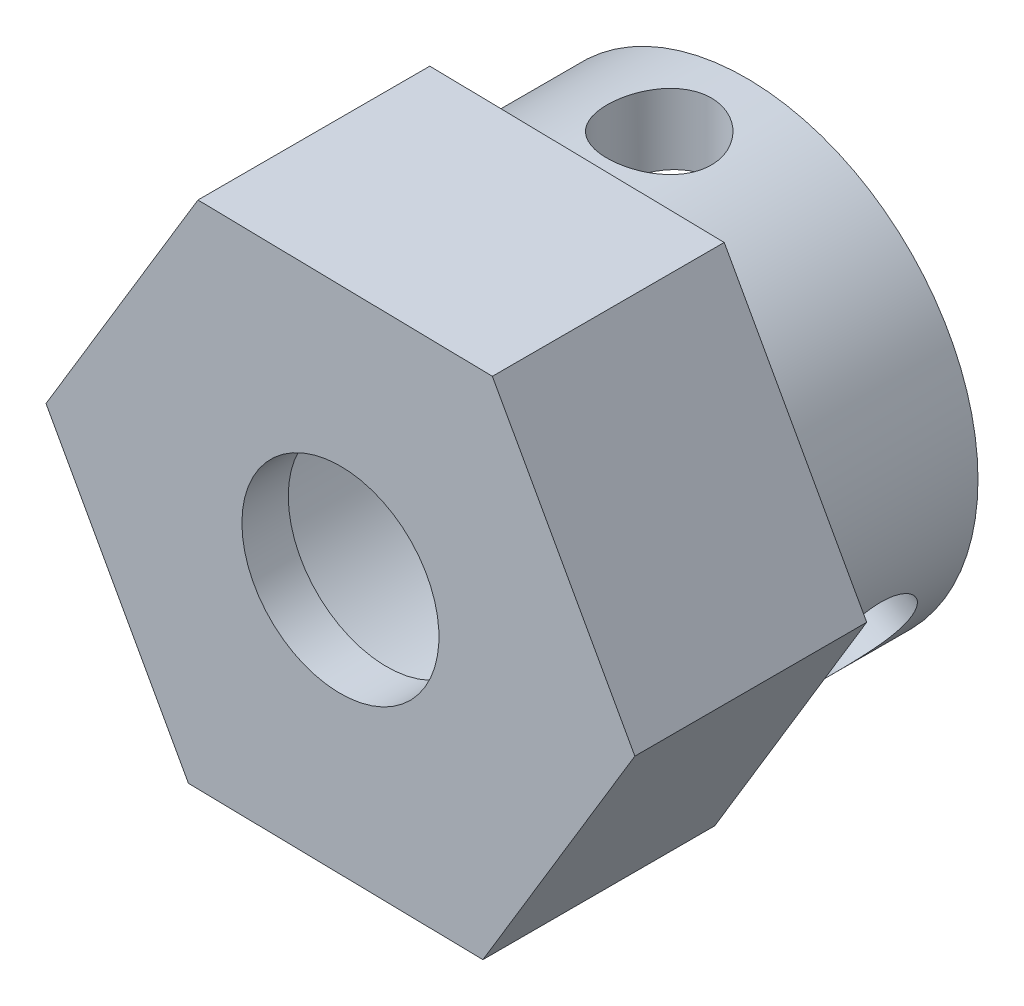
from build123d import *

# Parameters (mm, degrees)
SKETCH2_R           = 5.08
BOSS_EXTRUDE2_DEPTH = 8.89
BOSS_EXTRUDE3_DEPTH = 5.08
SKETCH3_R           = 3.556
CUT_EXTRUDE3_DEPTH  = 7.874
SKETCH6_R           = 2.159
CUT_EXTRUDE4_DEPTH  = 10.965704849
SKETCH7_R           = 1.143
CUT_EXTRUDE5_DEPTH  = 13.350747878
CIRPATTERN1_COUNT   = 3


with BuildPart() as part:
    # Sketch2 → Boss-Extrude2 (new body)
    with BuildSketch(Plane.XY):
        Circle(SKETCH2_R)
    extrude(amount=-BOSS_EXTRUDE2_DEPTH)

    # Sketch5 → Boss-Extrude3 (add)
    with BuildSketch(Plane.XY):
        Polygon((6.451350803, -0.119992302), (3.329591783, 5.527037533), (-3.12175902, 5.647029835), (-6.451350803, 0.119992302), (-3.329591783, -5.527037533), (3.12175902, -5.647029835), align=None)
    extrude(amount=-BOSS_EXTRUDE3_DEPTH)

    # Sketch3 → Cut-Extrude3 (cut)
    with BuildSketch(Plane(origin=(0, 0, -8.89), x_dir=(-1, 0, 0), z_dir=(0, 0, -1))):
        Circle(SKETCH3_R)
    extrude(amount=-CUT_EXTRUDE3_DEPTH, mode=Mode.SUBTRACT)

    # Sketch6 → Cut-Extrude4 (cut, through all)
    with BuildSketch(Plane(origin=(0, 0, -5.08), x_dir=(-1, 0, 0), z_dir=(0, 0, -1))):
        Circle(SKETCH6_R)
    extrude(amount=-CUT_EXTRUDE4_DEPTH, mode=Mode.SUBTRACT)

    # Sketch7 → Cut-Extrude5 (cut, through all)
    with BuildSketch(Plane(origin=(0, 0, 0), x_dir=(1, 0, 0), z_dir=(0, 1, 0))):
        with Locations(Location((0, 6.985, 0), (0, 0, 90))):
            Circle(SKETCH7_R)
    cut_extrude5 = extrude(amount=CUT_EXTRUDE5_DEPTH, mode=Mode.SUBTRACT)

    # CirPattern1: Cut-Extrude5 ×3 about axis
    cirpattern1_axis = Axis((0, 0, 0), (0, 0, -1))
    for i in range(1, CIRPATTERN1_COUNT):
        add(cut_extrude5.rotate(cirpattern1_axis, i * 360 / CIRPATTERN1_COUNT), mode=Mode.SUBTRACT)


solid = part.part
